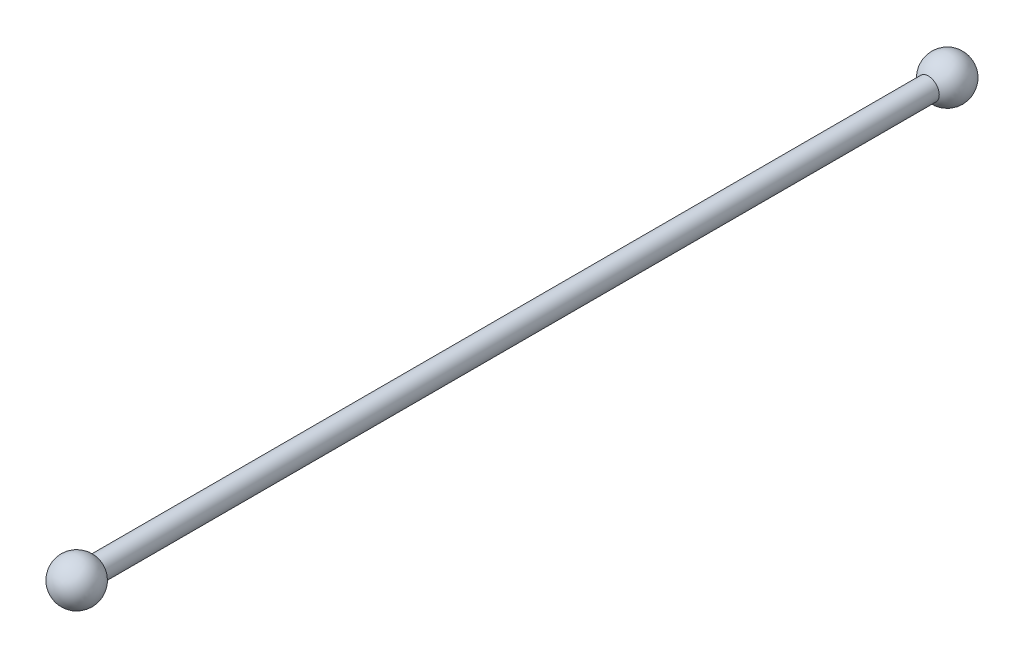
from build123d import *

# Parameters (mm, degrees)
SKETCH2_R           = 25
BOSS_EXTRUDE1_DEPTH = 1000


with BuildPart() as part:
    # Sketch2 → Boss-Extrude1 (new, symmetric)
    with BuildSketch(Plane.XY):
        Circle(SKETCH2_R)
    extrude(amount=BOSS_EXTRUDE1_DEPTH, both=True)

    # Sketch3 → Revolve1 (revolve)
    with BuildSketch(Plane(origin=(0, 0, 0), x_dir=(1, 0, 0), z_dir=(0, 1, 0))):
        with BuildLine():
            Line((0, -950), (0, -1050))
            ThreePointArc((0, -1050), (50, -1000), (0, -950))
        make_face()
    revolve1 = revolve(axis=Axis((0, 0, 950), (0, 0, 1)))

    # Mirror1: Revolve1 across plane
    add(revolve1.mirror(Plane.XY))


solid = part.part
